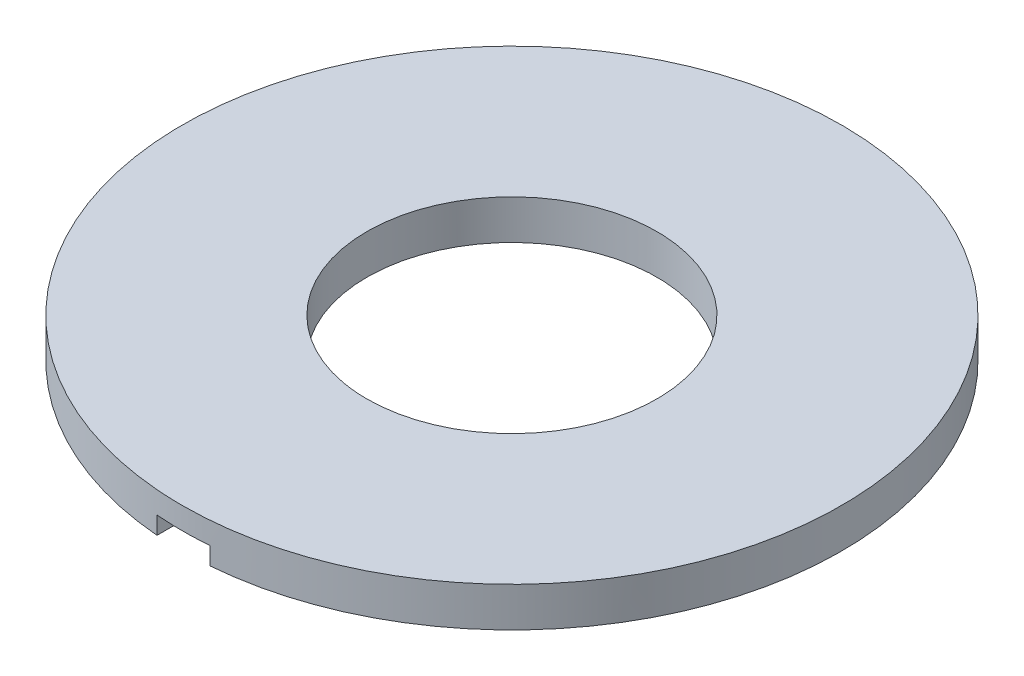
ISO-10303-21;
HEADER;
FILE_DESCRIPTION(('STEP AP214'),'2;1');
FILE_NAME('part.step','',(''),(''),'','','');
FILE_SCHEMA(('AUTOMOTIVE_DESIGN { 1 0 10303 214 1 1 1 1 }'));
ENDSEC;
DATA;
#1=APPLICATION_CONTEXT('core data for automotive mechanical design processes');
#2=APPLICATION_PROTOCOL_DEFINITION('international standard','automotive_design',2000,#1);
#3=PRODUCT_CONTEXT('',#1,'mechanical');
#4=PRODUCT('Part','Part','',(#3));
#5=PRODUCT_RELATED_PRODUCT_CATEGORY('part','',(#4));
#6=PRODUCT_DEFINITION_FORMATION('','',#4);
#7=PRODUCT_DEFINITION_CONTEXT('part definition',#1,'design');
#8=PRODUCT_DEFINITION('design','',#6,#7);
#9=PRODUCT_DEFINITION_SHAPE('','',#8);
#10=(LENGTH_UNIT() NAMED_UNIT(*) SI_UNIT(.MILLI.,.METRE.));
#11=(NAMED_UNIT(*) PLANE_ANGLE_UNIT() SI_UNIT($,.RADIAN.));
#12=(NAMED_UNIT(*) SI_UNIT($,.STERADIAN.) SOLID_ANGLE_UNIT());
#13=UNCERTAINTY_MEASURE_WITH_UNIT(LENGTH_MEASURE(1.E-05),#10,'distance_accuracy_value','');
#14=(GEOMETRIC_REPRESENTATION_CONTEXT(3) GLOBAL_UNCERTAINTY_ASSIGNED_CONTEXT((#13)) GLOBAL_UNIT_ASSIGNED_CONTEXT((#10,
#11,#12)) REPRESENTATION_CONTEXT('',''));
#15=CARTESIAN_POINT('',(0.,0.,0.));
#16=DIRECTION('',(0.,0.,1.));
#17=DIRECTION('',(1.,0.,0.));
#18=AXIS2_PLACEMENT_3D('',#15,#16,#17);
#19=CARTESIAN_POINT('',(0.,0.3,0.));
#20=DIRECTION('',(0.,1.,0.));
#21=DIRECTION('',(0.,0.,1.));
#22=AXIS2_PLACEMENT_3D('',#19,#20,#21);
#23=PLANE('',#22);
#24=CARTESIAN_POINT('',(0.,0.3,0.));
#25=DIRECTION('',(0.,1.,0.));
#26=DIRECTION('',(0.,0.,1.));
#27=AXIS2_PLACEMENT_3D('',#24,#25,#26);
#28=CIRCLE('',#27,2.5);
#29=CARTESIAN_POINT('',(0.,0.3,2.5));
#30=VERTEX_POINT('',#29);
#31=EDGE_CURVE('E112',#30,#30,#28,.T.);
#32=ORIENTED_EDGE('',*,*,#31,.T.);
#33=EDGE_LOOP('',(#32));
#34=FACE_BOUND('',#33,.T.);
#35=CARTESIAN_POINT('',(0.,0.3,0.));
#36=DIRECTION('',(0.,1.,0.));
#37=DIRECTION('',(0.,0.,1.));
#38=AXIS2_PLACEMENT_3D('',#35,#36,#37);
#39=CIRCLE('',#38,1.1);
#40=CARTESIAN_POINT('',(0.,0.3,1.1));
#41=VERTEX_POINT('',#40);
#42=EDGE_CURVE('E102',#41,#41,#39,.T.);
#43=ORIENTED_EDGE('',*,*,#42,.F.);
#44=EDGE_LOOP('',(#43));
#45=FACE_BOUND('',#44,.T.);
#46=ADVANCED_FACE('F39',(#34,#45),#23,.T.);
#47=CARTESIAN_POINT('',(0.,0.,0.));
#48=DIRECTION('',(0.,1.,0.));
#49=DIRECTION('',(0.,0.,1.));
#50=AXIS2_PLACEMENT_3D('',#47,#48,#49);
#51=PLANE('',#50);
#52=CARTESIAN_POINT('',(0.,0.,0.));
#53=DIRECTION('',(0.,1.,0.));
#54=DIRECTION('',(0.,0.,1.));
#55=AXIS2_PLACEMENT_3D('',#52,#53,#54);
#56=CIRCLE('',#55,2.5);
#57=CARTESIAN_POINT('',(0.2,0.,2.49198715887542));
#58=VERTEX_POINT('',#57);
#59=CARTESIAN_POINT('',(-0.2,0.,2.49198715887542));
#60=VERTEX_POINT('',#59);
#61=EDGE_CURVE('E94',#58,#60,#56,.T.);
#62=ORIENTED_EDGE('',*,*,#61,.F.);
#63=DIRECTION('',(0.,0.,1.));
#64=VECTOR('',#63,1.);
#65=CARTESIAN_POINT('',(0.2,0.,-0.3));
#66=LINE('',#65,#64);
#67=CARTESIAN_POINT('',(0.2,0.,1.0816653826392));
#68=VERTEX_POINT('',#67);
#69=EDGE_CURVE('E81',#68,#58,#66,.T.);
#70=ORIENTED_EDGE('',*,*,#69,.F.);
#71=CARTESIAN_POINT('',(0.,0.,0.));
#72=DIRECTION('',(0.,1.,0.));
#73=DIRECTION('',(0.,0.,1.));
#74=AXIS2_PLACEMENT_3D('',#71,#72,#73);
#75=CIRCLE('',#74,1.1);
#76=CARTESIAN_POINT('',(-0.2,0.,1.0816653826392));
#77=VERTEX_POINT('',#76);
#78=EDGE_CURVE('E92',#68,#77,#75,.T.);
#79=ORIENTED_EDGE('',*,*,#78,.T.);
#80=DIRECTION('',(0.,0.,-1.));
#81=VECTOR('',#80,1.);
#82=CARTESIAN_POINT('',(-0.2,0.,-0.3));
#83=LINE('',#82,#81);
#84=EDGE_CURVE('E96',#60,#77,#83,.T.);
#85=ORIENTED_EDGE('',*,*,#84,.F.);
#86=EDGE_LOOP('',(#62,#70,#79,#85));
#87=FACE_BOUND('',#86,.T.);
#88=ADVANCED_FACE('F90',(#87),#51,.F.);
#89=CARTESIAN_POINT('',(0.,0.3,0.));
#90=DIRECTION('',(0.,-1.,0.));
#91=DIRECTION('',(0.,0.,-1.));
#92=AXIS2_PLACEMENT_3D('',#89,#90,#91);
#93=CYLINDRICAL_SURFACE('',#92,2.5);
#94=ORIENTED_EDGE('',*,*,#31,.F.);
#95=EDGE_LOOP('',(#94));
#96=FACE_BOUND('',#95,.T.);
#97=CARTESIAN_POINT('',(0.,0.133333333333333,0.));
#98=DIRECTION('',(0.,1.,0.));
#99=DIRECTION('',(0.,0.,1.));
#100=AXIS2_PLACEMENT_3D('',#97,#98,#99);
#101=CIRCLE('',#100,2.5);
#102=CARTESIAN_POINT('',(-0.2,0.133333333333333,2.49198715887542));
#103=VERTEX_POINT('',#102);
#104=CARTESIAN_POINT('',(0.2,0.133333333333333,2.49198715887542));
#105=VERTEX_POINT('',#104);
#106=EDGE_CURVE('E60',#103,#105,#101,.T.);
#107=ORIENTED_EDGE('',*,*,#106,.T.);
#108=DIRECTION('',(0.,-1.,0.));
#109=VECTOR('',#108,1.);
#110=CARTESIAN_POINT('',(0.2,0.3,2.49198715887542));
#111=LINE('',#110,#109);
#112=EDGE_CURVE('E103',#105,#58,#111,.T.);
#113=ORIENTED_EDGE('',*,*,#112,.T.);
#114=ORIENTED_EDGE('',*,*,#61,.T.);
#115=DIRECTION('',(0.,-1.,0.));
#116=VECTOR('',#115,1.);
#117=CARTESIAN_POINT('',(-0.2,0.3,2.49198715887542));
#118=LINE('',#117,#116);
#119=EDGE_CURVE('E109',#60,#103,#118,.F.);
#120=ORIENTED_EDGE('',*,*,#119,.T.);
#121=EDGE_LOOP('',(#107,#113,#114,#120));
#122=FACE_BOUND('',#121,.T.);
#123=ADVANCED_FACE('F41',(#96,#122),#93,.T.);
#124=CARTESIAN_POINT('',(0.,0.3,0.));
#125=DIRECTION('',(0.,-1.,0.));
#126=DIRECTION('',(0.,0.,-1.));
#127=AXIS2_PLACEMENT_3D('',#124,#125,#126);
#128=CYLINDRICAL_SURFACE('',#127,1.1);
#129=DIRECTION('',(0.,-1.,0.));
#130=VECTOR('',#129,1.);
#131=CARTESIAN_POINT('',(0.2,0.3,1.0816653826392));
#132=LINE('',#131,#130);
#133=CARTESIAN_POINT('',(0.2,0.133333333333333,1.0816653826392));
#134=VERTEX_POINT('',#133);
#135=EDGE_CURVE('E11',#134,#68,#132,.T.);
#136=ORIENTED_EDGE('',*,*,#135,.F.);
#137=CARTESIAN_POINT('',(0.,0.133333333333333,0.));
#138=DIRECTION('',(0.,1.,0.));
#139=DIRECTION('',(0.,0.,1.));
#140=AXIS2_PLACEMENT_3D('',#137,#138,#139);
#141=CIRCLE('',#140,1.1);
#142=CARTESIAN_POINT('',(-0.2,0.133333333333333,1.0816653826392));
#143=VERTEX_POINT('',#142);
#144=EDGE_CURVE('E116',#143,#134,#141,.T.);
#145=ORIENTED_EDGE('',*,*,#144,.F.);
#146=DIRECTION('',(0.,-1.,0.));
#147=VECTOR('',#146,1.);
#148=CARTESIAN_POINT('',(-0.2,0.3,1.0816653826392));
#149=LINE('',#148,#147);
#150=EDGE_CURVE('E48',#77,#143,#149,.F.);
#151=ORIENTED_EDGE('',*,*,#150,.F.);
#152=ORIENTED_EDGE('',*,*,#78,.F.);
#153=EDGE_LOOP('',(#136,#145,#151,#152));
#154=FACE_BOUND('',#153,.T.);
#155=ORIENTED_EDGE('',*,*,#42,.T.);
#156=EDGE_LOOP('',(#155));
#157=FACE_BOUND('',#156,.T.);
#158=ADVANCED_FACE('F99',(#154,#157),#128,.F.);
#159=CARTESIAN_POINT('',(0.2,0.133333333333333,-0.3));
#160=DIRECTION('',(1.,0.,0.));
#161=DIRECTION('',(0.,0.,-1.));
#162=AXIS2_PLACEMENT_3D('',#159,#160,#161);
#163=PLANE('',#162);
#164=DIRECTION('',(0.,0.,1.));
#165=VECTOR('',#164,1.);
#166=CARTESIAN_POINT('',(0.2,0.133333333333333,-0.3));
#167=LINE('',#166,#165);
#168=EDGE_CURVE('E83',#134,#105,#167,.T.);
#169=ORIENTED_EDGE('',*,*,#168,.F.);
#170=ORIENTED_EDGE('',*,*,#135,.T.);
#171=ORIENTED_EDGE('',*,*,#69,.T.);
#172=ORIENTED_EDGE('',*,*,#112,.F.);
#173=EDGE_LOOP('',(#169,#170,#171,#172));
#174=FACE_BOUND('',#173,.T.);
#175=ADVANCED_FACE('F79',(#174),#163,.F.);
#176=CARTESIAN_POINT('',(-0.2,0.133333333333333,-0.3));
#177=DIRECTION('',(-1.,0.,0.));
#178=DIRECTION('',(0.,0.,1.));
#179=AXIS2_PLACEMENT_3D('',#176,#177,#178);
#180=PLANE('',#179);
#181=ORIENTED_EDGE('',*,*,#84,.T.);
#182=ORIENTED_EDGE('',*,*,#150,.T.);
#183=DIRECTION('',(0.,0.,-1.));
#184=VECTOR('',#183,1.);
#185=CARTESIAN_POINT('',(-0.2,0.133333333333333,-0.3));
#186=LINE('',#185,#184);
#187=EDGE_CURVE('E55',#103,#143,#186,.T.);
#188=ORIENTED_EDGE('',*,*,#187,.F.);
#189=ORIENTED_EDGE('',*,*,#119,.F.);
#190=EDGE_LOOP('',(#181,#182,#188,#189));
#191=FACE_BOUND('',#190,.T.);
#192=ADVANCED_FACE('F123',(#191),#180,.F.);
#193=CARTESIAN_POINT('',(0.,0.133333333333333,0.));
#194=DIRECTION('',(0.,1.,0.));
#195=DIRECTION('',(0.,0.,1.));
#196=AXIS2_PLACEMENT_3D('',#193,#194,#195);
#197=PLANE('',#196);
#198=ORIENTED_EDGE('',*,*,#106,.F.);
#199=ORIENTED_EDGE('',*,*,#187,.T.);
#200=ORIENTED_EDGE('',*,*,#144,.T.);
#201=ORIENTED_EDGE('',*,*,#168,.T.);
#202=EDGE_LOOP('',(#198,#199,#200,#201));
#203=FACE_BOUND('',#202,.T.);
#204=ADVANCED_FACE('F125',(#203),#197,.F.);
#205=CLOSED_SHELL('',(#46,#88,#123,#158,#175,#192,#204));
#206=MANIFOLD_SOLID_BREP('B2',#205);
#207=ADVANCED_BREP_SHAPE_REPRESENTATION('',(#18,#206),#14);
#208=SHAPE_DEFINITION_REPRESENTATION(#9,#207);
ENDSEC;
END-ISO-10303-21;
